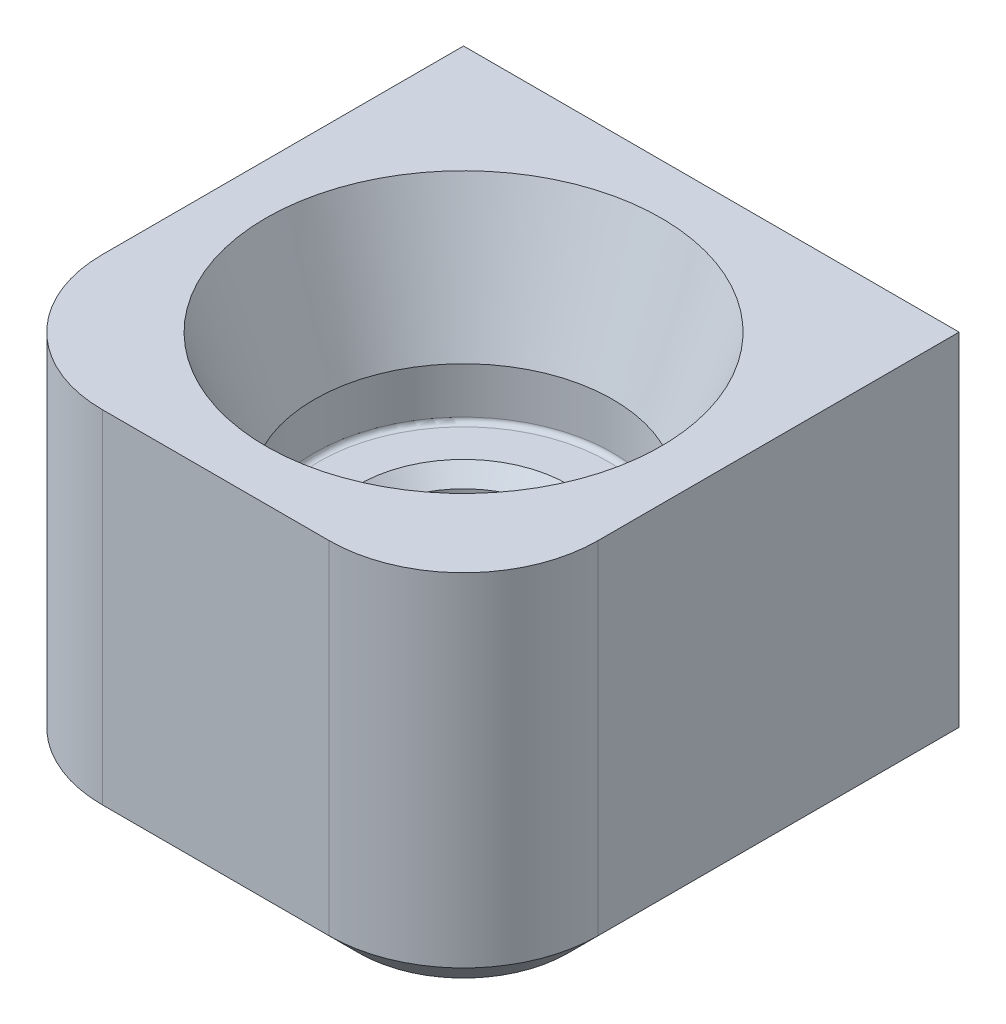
from build123d import *

# Parameters (mm, degrees)
BOSS_EXTRUDE1_DEPTH = 9.4996
CHAMFER1_SIZE       = 0.762
CHAMFER2_SIZE       = 0.381


with BuildPart() as part:
    # Sketch1 → Boss-Extrude1 (new body)
    with BuildSketch(Plane(origin=(0, 0, 0), x_dir=(1, 0, 0), z_dir=(0, 1, 0))):
        with BuildLine():
            Line((-6.3246, 6.3246), (6.3246, 6.3246))
            Line((6.3246, 6.3246), (6.3246, -2.8956))
            ThreePointArc((6.3246, -2.8956), (5.320269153, -5.320269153), (2.8956, -6.3246))
            Line((2.8956, -6.3246), (-2.8956, -6.3246))
            ThreePointArc((-2.8956, -6.3246), (-5.320269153, -5.320269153), (-6.3246, -2.8956))
            Line((-6.3246, -2.8956), (-6.3246, 6.3246))
        make_face()
    extrude(amount=BOSS_EXTRUDE1_DEPTH)

    # Sketch2 → Cut-Revolve1 (revolve, cut)
    with BuildSketch(Plane.XY):
        with BuildLine():
            Line((-5.045034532, 9.4996), (-3.81, 6.106370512))
            Line((-3.81, 6.106370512), (-3.81, 4.9276))
            ThreePointArc((-3.81, 4.9276), (-3.772802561, 4.837797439), (-3.683, 4.8006))
            Line((-3.683, 4.8006), (-2.286, 4.8006))
            Line((-2.286, 4.8006), (-2.286, 0))
            Line((-2.286, 0), (0, 0))
            Line((0, 0), (0, 9.4996))
            Line((0, 9.4996), (-5.045034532, 9.4996))
        make_face()
    revolve(axis=Axis((0, 9.4996, 0), (0, -1, 0)), mode=Mode.SUBTRACT)

    # Chamfer1
    chamfer1_edges = [part.edges().sort_by_distance(p)[0] for p in [
        (0, 0, -6.3246),
        (6.3246, 0, -1.7145),
        (5.320269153, 0, 5.320269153),
        (0, 0, 6.3246),
        (-5.320269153, 0, 5.320269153),
        (-6.3246, 0, -1.7145),
    ]]
    chamfer(chamfer1_edges, length=CHAMFER1_SIZE)

    # Chamfer2
    chamfer2_edges = [part.edges().sort_by_distance(p)[0] for p in [
        (2.286, 0, 0),
        (2.286, 4.8006, 0),
    ]]
    chamfer(chamfer2_edges, length=CHAMFER2_SIZE)


solid = part.part
